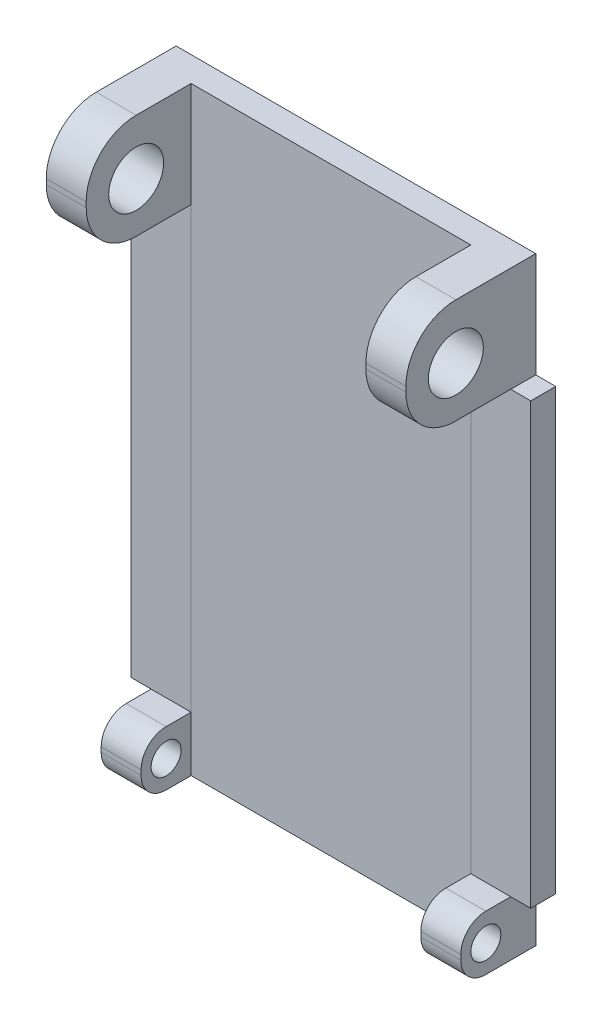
from build123d import *
from OCP.BRepFilletAPI import BRepFilletAPI_MakeFillet

# Parameters (mm, degrees)
CROQUIS1_W              = 40
CROQUIS1_H              = 60
SALIENTE_EXTRUIR1_DEPTH = 13
CROQUIS19_W             = 5.497004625
CROQUIS19_H             = 49.49
CORTAR_EXTRUIR6_DEPTH   = 40
CROQUIS17_R             = 1.5
CORTAR_EXTRUIR8_DEPTH   = 40
CROQUIS20_W             = 5
CROQUIS20_H             = 44
CORTAR_EXTRUIR11_DEPTH  = 40
CROQUIS23_W             = 28
CROQUIS23_H             = 10.7
CORTAR_EXTRUIR12_DEPTH  = 60.5
CROQUIS24_R             = 2.75
CORTAR_EXTRUIR13_DEPTH  = 40
REDONDEO2_R1            = 2.5
REDONDEO2_R2            = 5
CROQUIS25_W             = 2
CROQUIS25_H             = 13
CORTAR_EXTRUIR15_DEPTH  = 10.51
MATRIZC1_COUNT          = 2
CROQUIS27_W             = 2
CROQUIS27_H             = 7.52
CORTAR_EXTRUIR16_DEPTH  = 5.5
CROQUIS28_W             = 2
CROQUIS28_H             = 7.52
CORTAR_EXTRUIR17_DEPTH  = 5.5
CROQUIS29_W             = 2
CROQUIS29_H             = 9.681242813
CORTAR_EXTRUIR18_DEPTH  = 3


with BuildPart() as part:
    # Croquis1 → Saliente-Extruir1 (new body)
    with BuildSketch(Plane.XY):
        Rectangle(CROQUIS1_W, CROQUIS1_H)
    extrude(amount=SALIENTE_EXTRUIR1_DEPTH)

    # Croquis19 → Cortar-Extruir6 (cut)
    with BuildSketch(Plane(origin=(20, 0, 0), x_dir=(0, 0, -1), z_dir=(1, 0, 0))):
        with Locations((-10.251497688, -5.255)):
            Rectangle(CROQUIS19_W, CROQUIS19_H)
    extrude(amount=-CORTAR_EXTRUIR6_DEPTH, mode=Mode.SUBTRACT)

    # Croquis17 → Cortar-Extruir8 (cut)
    with BuildSketch(Plane(origin=(20, 0, 0), x_dir=(0, 0, -1), z_dir=(1, 0, 0))):
        with Locations((-5, -27.27)):
            Circle(CROQUIS17_R)
    extrude(amount=-CORTAR_EXTRUIR8_DEPTH, mode=Mode.SUBTRACT)

    # Croquis20 → Cortar-Extruir11 (cut)
    with BuildSketch(Plane(origin=(20, 0, 0), x_dir=(0, 0, -1), z_dir=(1, 0, 0))):
        with Locations((-5.002995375, -2.5)):
            Rectangle(CROQUIS20_W, CROQUIS20_H)
    extrude(amount=-CORTAR_EXTRUIR11_DEPTH, mode=Mode.SUBTRACT)

    # Croquis23 → Cortar-Extruir12 (cut)
    with BuildSketch(Plane(origin=(0, 30, 0), x_dir=(1, 0, 0), z_dir=(0, 1, 0))):
        with Locations((0, -7.85)):
            Rectangle(CROQUIS23_W, CROQUIS23_H)
    extrude(amount=-CORTAR_EXTRUIR12_DEPTH, mode=Mode.SUBTRACT)

    # Croquis24 → Cortar-Extruir13 (cut)
    with BuildSketch(Plane(origin=(20, 0, 0), x_dir=(0, 0, -1), z_dir=(1, 0, 0))):
        with Locations((-8, 24.5)):
            Circle(CROQUIS24_R)
    extrude(amount=-CORTAR_EXTRUIR13_DEPTH, mode=Mode.SUBTRACT)

    # Redondeo2: one fillet with a radius per group of edges: ONE call of the kernel's fillet builder (fillet() takes one radius for all edges)
    redondeo2_edges_1 = [part.edges().sort_by_distance(p)[0] for p in [
        (17, -24.5, 7.502995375),
        (17, -30, 7.502995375),
        (-17, -30, 7.502995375),
        (-17, -24.5, 7.502995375),
    ]]
    redondeo2_edges_2 = [part.edges().sort_by_distance(p)[0] for p in [
        (17, 19.49, 13),
        (17, 30, 13),
        (-17, 19.49, 13),
        (-17, 30, 13),
    ]]
    redondeo2 = BRepFilletAPI_MakeFillet(part.part.solid().wrapped)
    for e in redondeo2_edges_1:
        redondeo2.Add(REDONDEO2_R1, e.wrapped)
    for e in redondeo2_edges_2:
        redondeo2.Add(REDONDEO2_R2, e.wrapped)
    add(Compound.cast(redondeo2.Shape()), mode=Mode.REPLACE)

    # Croquis25 → Cortar-Extruir15 (cut)
    with BuildSketch(Plane(origin=(0, 30, 0), x_dir=(1, 0, 0), z_dir=(0, 1, 0))):
        with Locations((19, -6.5)):
            Rectangle(CROQUIS25_W, CROQUIS25_H)
    cortar_extruir15 = extrude(amount=-CORTAR_EXTRUIR15_DEPTH, mode=Mode.SUBTRACT)

    # MatrizC1: Cortar-Extruir15 ×2 about axis
    matrizc1_axis = Axis((0, 26.946865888, 5), (0, -1, 0))
    for i in range(1, MATRIZC1_COUNT):
        add(cortar_extruir15.rotate(matrizc1_axis, i * 360 / MATRIZC1_COUNT), mode=Mode.SUBTRACT)

    # Croquis27 → Cortar-Extruir16 (cut)
    with BuildSketch(Plane.XZ.offset(30)):
        with Locations((19, 3.76)):
            Rectangle(CROQUIS27_W, CROQUIS27_H)
    extrude(amount=-CORTAR_EXTRUIR16_DEPTH, mode=Mode.SUBTRACT)

    # Croquis28 → Cortar-Extruir17 (cut)
    with BuildSketch(Plane.XZ.offset(30)):
        with Locations((-19, 3.76)):
            Rectangle(CROQUIS28_W, CROQUIS28_H)
    extrude(amount=-CORTAR_EXTRUIR17_DEPTH, mode=Mode.SUBTRACT)

    # Croquis29 → Cortar-Extruir18 (cut)
    with BuildSketch(Plane(origin=(0, 0, 10), x_dir=(-1, 0, 0), z_dir=(0, 0, -1))):
        with Locations((19, 24.748045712)):
            Rectangle(CROQUIS29_W, CROQUIS29_H)
    extrude(amount=-CORTAR_EXTRUIR18_DEPTH, mode=Mode.SUBTRACT)


solid = part.part
